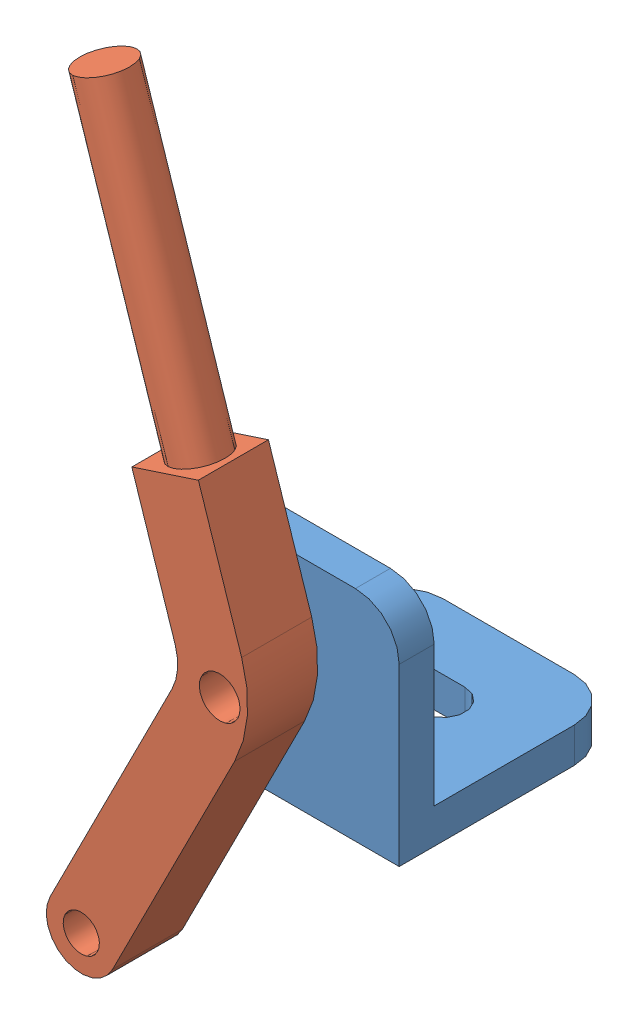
SolidWorks assembly Test Assembly_3.SLDASM, configuration Default (file format 13000). Lengths in mm.
Overall size (152.58 183.43 66).
2 component instances, 2 part files, 2 mates.
Components (placement in the parent):
- Base_2-1: Base_2.SLDPRT [Default] at origin size (50 50 50)
- Lever_2-1: Lever_2.SLDPRT [Default] at (0 29 8) x (0.892247 -0.451548 0) z (0 0 1) size (90.02 160.02 16)
Mates (geometry in assembly coordinates):
- Concentric1: concentric aligned: cylinder of Base_2-1 through (0 29 -8) axis (0 0 -1) radius 5; cylinder of Lever_2-1 through (0 29 16) axis (0 0 -1) radius 4.6527
- Coincident1: coincident anti-aligned: plane of Base_2-1 through (25 50 0) normal (0 0 1); plane of Lever_2-1 through (-21.5857 30.6393 0) normal (0 0 -1)
